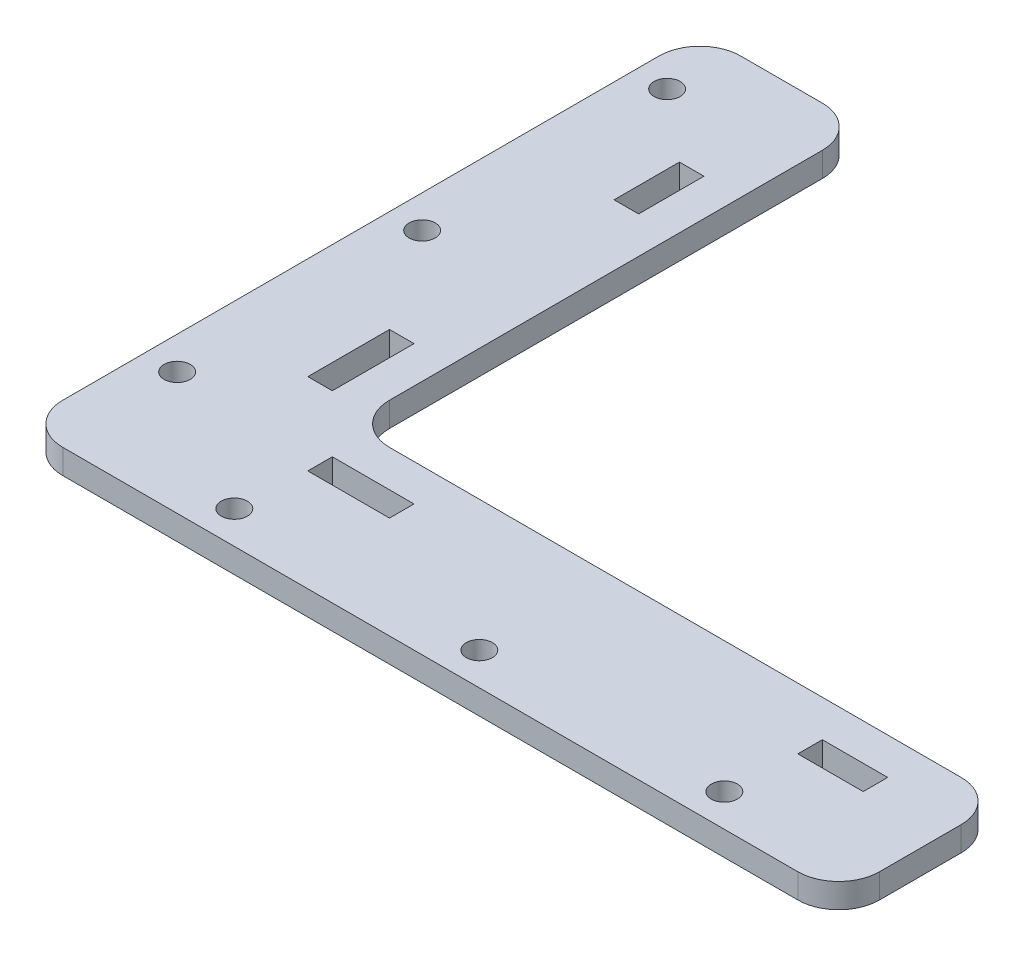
from build123d import *

# Parameters (mm, degrees)
EXTRUDE_2_DEPTH        = 3
SKETCH_2_W             = 10
SKETCH_2_H             = 3
SKETCH_2_W_2           = 8
SKETCH_2_W_3           = 3
SKETCH_2_H_2           = 10
SKETCH_2_H_3           = 8
CUT_EXTRUDE_1_DEPTH    = 10
FILLET_1_R             = 5
SKETCH_3_R             = 1.6
CUT_EXTRUDE_2_DEPTH    = 102.872469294
PATTERN_LINEAR_1_COUNT = 3
PATTERN_LINEAR_1_PITCH = 30
SKETCH_4_R             = 1.6
CUT_EXTRUDE_3_DEPTH    = 102.872469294
PATTERN_LINEAR_2_COUNT = 3
PATTERN_LINEAR_2_PITCH = 30


with BuildPart() as part:
    # Sketch 1 → Extrude 2 (new body)
    with BuildSketch(Plane(origin=(0, 0, 0), x_dir=(1, 0, 0), z_dir=(0, 1, 0))):
        Polygon((0, 0), (0, 63), (-20, 63), (-20, -20), (80, -20), (80, 0), align=None)
    extrude(amount=EXTRUDE_2_DEPTH)

    # Sketch 2 → Cut-Extrude 1 (cut)
    with BuildSketch(Plane.XZ):
        with Locations((7.5, 6)):
            Rectangle(SKETCH_2_W, SKETCH_2_H)
        with Locations((66.5, 6)):
            Rectangle(SKETCH_2_W_2, SKETCH_2_H)
        with Locations((-6, -7.5)):
            Rectangle(SKETCH_2_W_3, SKETCH_2_H_2)
        with Locations((-6, -44)):
            Rectangle(SKETCH_2_W_3, SKETCH_2_H_3)
    extrude(amount=-CUT_EXTRUDE_1_DEPTH, mode=Mode.SUBTRACT)

    # Fillet 1
    fillet_1_edges = [part.edges().sort_by_distance(p)[0] for p in [
        (80, 1.5, 0),
        (80, 1.5, 20),
        (-20, 1.5, 20),
        (-20, 1.5, -63),
        (0, 1.5, -63),
        (0, 1.5, 0),
    ]]
    fillet(fillet_1_edges, radius=FILLET_1_R)

    # Sketch 3 → Cut-Extrude 2 (cut, through all)
    with BuildSketch(Plane(origin=(0, 3, 0), x_dir=(1, 0, 0), z_dir=(0, 1, 0))):
        with Locations(Location((62, -16, 0), (0, 0, 270))):
            Circle(SKETCH_3_R)
    cut_extrude_2 = extrude(amount=-CUT_EXTRUDE_2_DEPTH, mode=Mode.SUBTRACT)

    # Pattern Linear 1: Cut-Extrude 2 ×3
    with Locations(*[(-i * PATTERN_LINEAR_1_PITCH, 0, 0) for i in range(1, PATTERN_LINEAR_1_COUNT)]):
        add(cut_extrude_2, mode=Mode.SUBTRACT)

    # Sketch 4 → Cut-Extrude 3 (cut, through all)
    with BuildSketch(Plane(origin=(0, 3, 0), x_dir=(1, 0, 0), z_dir=(0, 1, 0))):
        with Locations(Location((-16, 55, 0), (0, 0, 270))):
            Circle(SKETCH_4_R)
    cut_extrude_3 = extrude(amount=-CUT_EXTRUDE_3_DEPTH, mode=Mode.SUBTRACT)

    # Pattern Linear 2: Cut-Extrude 3 ×3
    with Locations(*[(0, 0, i * PATTERN_LINEAR_2_PITCH) for i in range(1, PATTERN_LINEAR_2_COUNT)]):
        add(cut_extrude_3, mode=Mode.SUBTRACT)


solid = part.part
